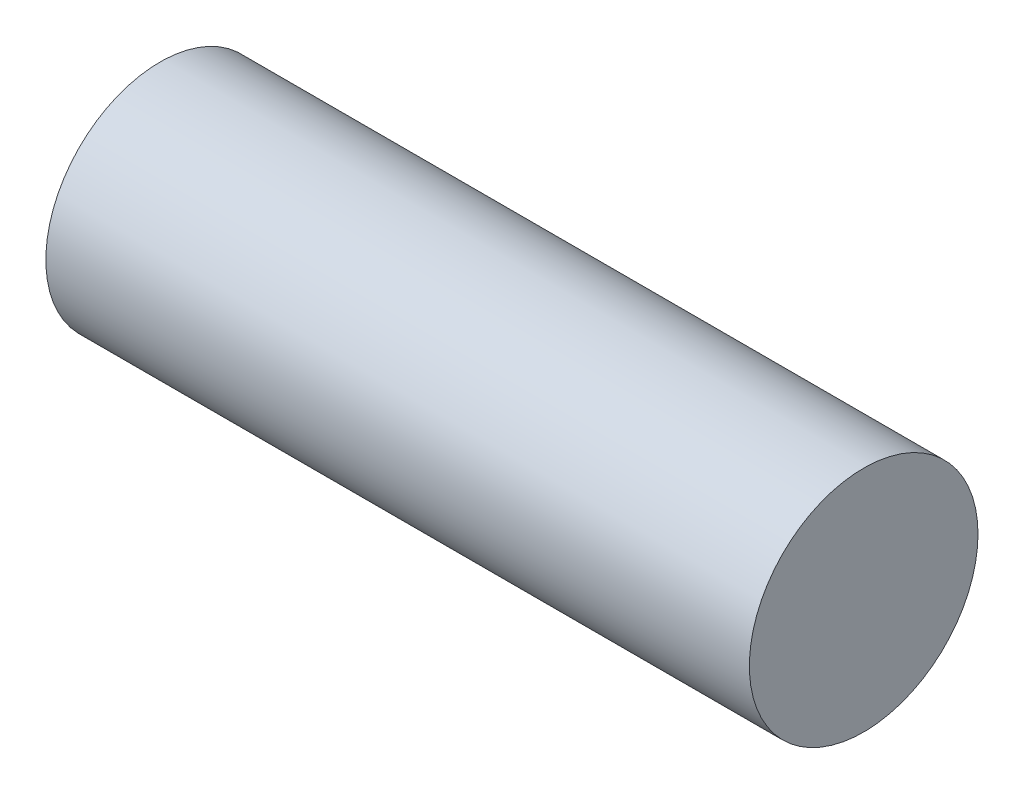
ISO-10303-21;
HEADER;
FILE_DESCRIPTION(('STEP AP214'),'2;1');
FILE_NAME('part.step','',(''),(''),'','','');
FILE_SCHEMA(('AUTOMOTIVE_DESIGN { 1 0 10303 214 1 1 1 1 }'));
ENDSEC;
DATA;
#1=APPLICATION_CONTEXT('core data for automotive mechanical design processes');
#2=APPLICATION_PROTOCOL_DEFINITION('international standard','automotive_design',2000,#1);
#3=PRODUCT_CONTEXT('',#1,'mechanical');
#4=PRODUCT('Part','Part','',(#3));
#5=PRODUCT_RELATED_PRODUCT_CATEGORY('part','',(#4));
#6=PRODUCT_DEFINITION_FORMATION('','',#4);
#7=PRODUCT_DEFINITION_CONTEXT('part definition',#1,'design');
#8=PRODUCT_DEFINITION('design','',#6,#7);
#9=PRODUCT_DEFINITION_SHAPE('','',#8);
#10=(LENGTH_UNIT() NAMED_UNIT(*) SI_UNIT(.MILLI.,.METRE.));
#11=(NAMED_UNIT(*) PLANE_ANGLE_UNIT() SI_UNIT($,.RADIAN.));
#12=(NAMED_UNIT(*) SI_UNIT($,.STERADIAN.) SOLID_ANGLE_UNIT());
#13=UNCERTAINTY_MEASURE_WITH_UNIT(LENGTH_MEASURE(1.E-05),#10,'distance_accuracy_value','');
#14=(GEOMETRIC_REPRESENTATION_CONTEXT(3) GLOBAL_UNCERTAINTY_ASSIGNED_CONTEXT((#13)) GLOBAL_UNIT_ASSIGNED_CONTEXT((#10,
#11,#12)) REPRESENTATION_CONTEXT('',''));
#15=CARTESIAN_POINT('',(0.,0.,0.));
#16=DIRECTION('',(0.,0.,1.));
#17=DIRECTION('',(1.,0.,0.));
#18=AXIS2_PLACEMENT_3D('',#15,#16,#17);
#19=CARTESIAN_POINT('',(8.,0.,0.));
#20=DIRECTION('',(-1.,0.,0.));
#21=DIRECTION('',(0.,0.,1.));
#22=AXIS2_PLACEMENT_3D('',#19,#20,#21);
#23=CYLINDRICAL_SURFACE('',#22,2.6);
#24=CARTESIAN_POINT('',(8.,0.,0.));
#25=DIRECTION('',(1.,0.,0.));
#26=DIRECTION('',(0.,0.,-1.));
#27=AXIS2_PLACEMENT_3D('',#24,#25,#26);
#28=CIRCLE('',#27,2.6);
#29=CARTESIAN_POINT('',(8.,0.,-2.6));
#30=VERTEX_POINT('',#29);
#31=EDGE_CURVE('E10',#30,#30,#28,.T.);
#32=ORIENTED_EDGE('',*,*,#31,.F.);
#33=EDGE_LOOP('',(#32));
#34=FACE_BOUND('',#33,.T.);
#35=CARTESIAN_POINT('',(-8.,0.,0.));
#36=DIRECTION('',(1.,0.,0.));
#37=DIRECTION('',(0.,0.,-1.));
#38=AXIS2_PLACEMENT_3D('',#35,#36,#37);
#39=CIRCLE('',#38,2.6);
#40=CARTESIAN_POINT('',(-8.,0.,-2.6));
#41=VERTEX_POINT('',#40);
#42=EDGE_CURVE('E31',#41,#41,#39,.T.);
#43=ORIENTED_EDGE('',*,*,#42,.T.);
#44=EDGE_LOOP('',(#43));
#45=FACE_BOUND('',#44,.T.);
#46=ADVANCED_FACE('F28',(#34,#45),#23,.T.);
#47=CARTESIAN_POINT('',(8.,0.,0.));
#48=DIRECTION('',(1.,0.,0.));
#49=DIRECTION('',(0.,0.,-1.));
#50=AXIS2_PLACEMENT_3D('',#47,#48,#49);
#51=PLANE('',#50);
#52=ORIENTED_EDGE('',*,*,#31,.T.);
#53=EDGE_LOOP('',(#52));
#54=FACE_BOUND('',#53,.T.);
#55=ADVANCED_FACE('F43',(#54),#51,.T.);
#56=CARTESIAN_POINT('',(-8.,0.,0.));
#57=DIRECTION('',(1.,0.,0.));
#58=DIRECTION('',(0.,0.,-1.));
#59=AXIS2_PLACEMENT_3D('',#56,#57,#58);
#60=PLANE('',#59);
#61=ORIENTED_EDGE('',*,*,#42,.F.);
#62=EDGE_LOOP('',(#61));
#63=FACE_BOUND('',#62,.T.);
#64=ADVANCED_FACE('F41',(#63),#60,.F.);
#65=CLOSED_SHELL('',(#46,#55,#64));
#66=MANIFOLD_SOLID_BREP('B2',#65);
#67=ADVANCED_BREP_SHAPE_REPRESENTATION('',(#18,#66),#14);
#68=SHAPE_DEFINITION_REPRESENTATION(#9,#67);
ENDSEC;
END-ISO-10303-21;
